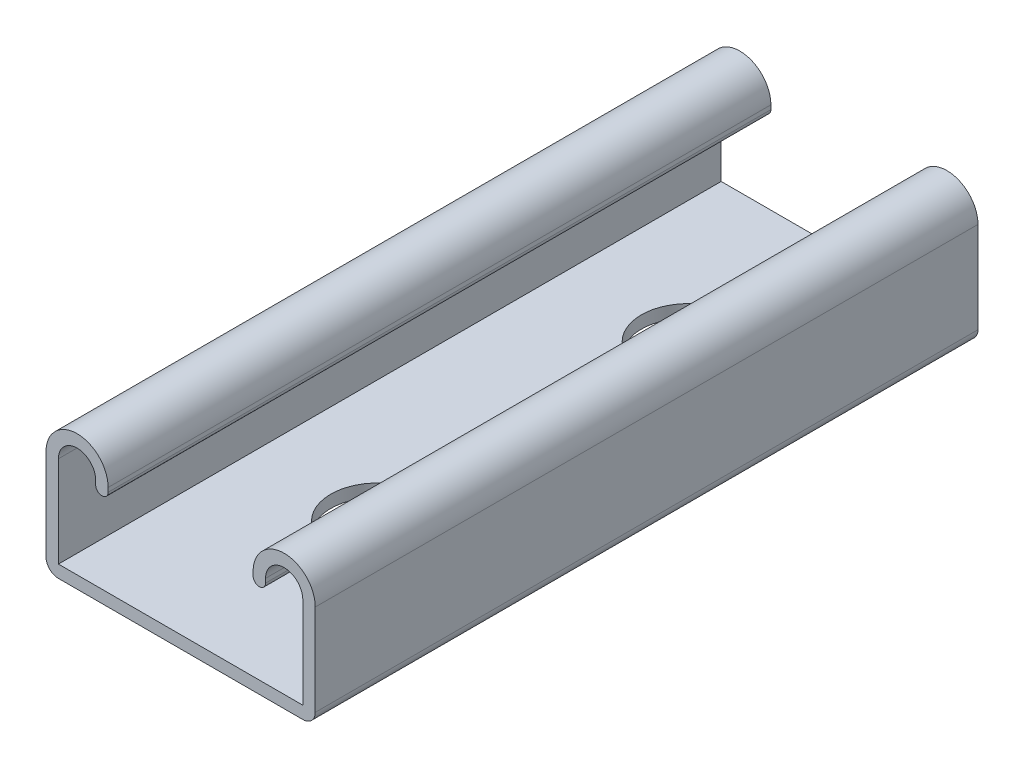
ISO-10303-21;
HEADER;
FILE_DESCRIPTION(('STEP AP214'),'2;1');
FILE_NAME('part.step','',(''),(''),'','','');
FILE_SCHEMA(('AUTOMOTIVE_DESIGN { 1 0 10303 214 1 1 1 1 }'));
ENDSEC;
DATA;
#1=APPLICATION_CONTEXT('core data for automotive mechanical design processes');
#2=APPLICATION_PROTOCOL_DEFINITION('international standard','automotive_design',2000,#1);
#3=PRODUCT_CONTEXT('',#1,'mechanical');
#4=PRODUCT('Part','Part','',(#3));
#5=PRODUCT_RELATED_PRODUCT_CATEGORY('part','',(#4));
#6=PRODUCT_DEFINITION_FORMATION('','',#4);
#7=PRODUCT_DEFINITION_CONTEXT('part definition',#1,'design');
#8=PRODUCT_DEFINITION('design','',#6,#7);
#9=PRODUCT_DEFINITION_SHAPE('','',#8);
#10=(LENGTH_UNIT() NAMED_UNIT(*) SI_UNIT(.MILLI.,.METRE.));
#11=(NAMED_UNIT(*) PLANE_ANGLE_UNIT() SI_UNIT($,.RADIAN.));
#12=(NAMED_UNIT(*) SI_UNIT($,.STERADIAN.) SOLID_ANGLE_UNIT());
#13=UNCERTAINTY_MEASURE_WITH_UNIT(LENGTH_MEASURE(1.E-05),#10,'distance_accuracy_value','');
#14=(GEOMETRIC_REPRESENTATION_CONTEXT(3) GLOBAL_UNCERTAINTY_ASSIGNED_CONTEXT((#13)) GLOBAL_UNIT_ASSIGNED_CONTEXT((#10,
#11,#12)) REPRESENTATION_CONTEXT('',''));
#15=CARTESIAN_POINT('',(0.,0.,0.));
#16=DIRECTION('',(0.,0.,1.));
#17=DIRECTION('',(1.,0.,0.));
#18=AXIS2_PLACEMENT_3D('',#15,#16,#17);
#19=CARTESIAN_POINT('',(-15.875,7.4295,101.6));
#20=DIRECTION('',(0.,0.,-1.));
#21=DIRECTION('',(-1.,0.,0.));
#22=AXIS2_PLACEMENT_3D('',#19,#20,#21);
#23=CYLINDRICAL_SURFACE('',#22,4.7625);
#24=CARTESIAN_POINT('',(-15.875,7.4295,0.));
#25=DIRECTION('',(0.,0.,1.));
#26=DIRECTION('',(-1.,0.,0.));
#27=AXIS2_PLACEMENT_3D('',#24,#25,#26);
#28=CIRCLE('',#27,4.7625);
#29=CARTESIAN_POINT('',(-11.1125,7.4295,0.));
#30=VERTEX_POINT('',#29);
#31=CARTESIAN_POINT('',(-20.6375,7.4295,0.));
#32=VERTEX_POINT('',#31);
#33=EDGE_CURVE('E190',#30,#32,#28,.T.);
#34=ORIENTED_EDGE('',*,*,#33,.T.);
#35=DIRECTION('',(0.,0.,-1.));
#36=VECTOR('',#35,1.);
#37=CARTESIAN_POINT('',(-20.6375,7.4295,101.6));
#38=LINE('',#37,#36);
#39=CARTESIAN_POINT('',(-20.6375,7.4295,101.6));
#40=VERTEX_POINT('',#39);
#41=EDGE_CURVE('E11',#40,#32,#38,.T.);
#42=ORIENTED_EDGE('',*,*,#41,.F.);
#43=CARTESIAN_POINT('',(-15.875,7.4295,101.6));
#44=DIRECTION('',(0.,0.,1.));
#45=DIRECTION('',(-1.,0.,0.));
#46=AXIS2_PLACEMENT_3D('',#43,#44,#45);
#47=CIRCLE('',#46,4.7625);
#48=CARTESIAN_POINT('',(-11.1125,7.4295,101.6));
#49=VERTEX_POINT('',#48);
#50=EDGE_CURVE('E224',#49,#40,#47,.T.);
#51=ORIENTED_EDGE('',*,*,#50,.F.);
#52=DIRECTION('',(0.,0.,-1.));
#53=VECTOR('',#52,1.);
#54=CARTESIAN_POINT('',(-11.1125,7.4295,101.6));
#55=LINE('',#54,#53);
#56=EDGE_CURVE('E186',#49,#30,#55,.T.);
#57=ORIENTED_EDGE('',*,*,#56,.T.);
#58=EDGE_LOOP('',(#34,#42,#51,#57));
#59=FACE_BOUND('',#58,.T.);
#60=ADVANCED_FACE('F33',(#59),#23,.T.);
#61=CARTESIAN_POINT('',(-20.6375,7.4295,101.6));
#62=DIRECTION('',(1.,0.,0.));
#63=DIRECTION('',(0.,0.,-1.));
#64=AXIS2_PLACEMENT_3D('',#61,#62,#63);
#65=PLANE('',#64);
#66=DIRECTION('',(0.,-1.,0.));
#67=VECTOR('',#66,1.);
#68=CARTESIAN_POINT('',(-20.6375,7.4295,0.));
#69=LINE('',#68,#67);
#70=CARTESIAN_POINT('',(-20.6375,-6.5532,0.));
#71=VERTEX_POINT('',#70);
#72=EDGE_CURVE('E193',#32,#71,#69,.T.);
#73=ORIENTED_EDGE('',*,*,#72,.T.);
#74=DIRECTION('',(0.,0.,-1.));
#75=VECTOR('',#74,1.);
#76=CARTESIAN_POINT('',(-20.6375,-6.5532,101.6));
#77=LINE('',#76,#75);
#78=CARTESIAN_POINT('',(-20.6375,-6.5532,101.6));
#79=VERTEX_POINT('',#78);
#80=EDGE_CURVE('E42',#79,#71,#77,.T.);
#81=ORIENTED_EDGE('',*,*,#80,.F.);
#82=DIRECTION('',(0.,-1.,0.));
#83=VECTOR('',#82,1.);
#84=CARTESIAN_POINT('',(-20.6375,7.4295,101.6));
#85=LINE('',#84,#83);
#86=EDGE_CURVE('E123',#40,#79,#85,.T.);
#87=ORIENTED_EDGE('',*,*,#86,.F.);
#88=ORIENTED_EDGE('',*,*,#41,.T.);
#89=EDGE_LOOP('',(#73,#81,#87,#88));
#90=FACE_BOUND('',#89,.T.);
#91=ADVANCED_FACE('F333',(#90),#65,.F.);
#92=CARTESIAN_POINT('',(-18.7325,-6.5532,101.6));
#93=DIRECTION('',(0.,0.,-1.));
#94=DIRECTION('',(-1.,0.,0.));
#95=AXIS2_PLACEMENT_3D('',#92,#93,#94);
#96=CYLINDRICAL_SURFACE('',#95,1.905);
#97=CARTESIAN_POINT('',(-18.7325,-6.5532,0.));
#98=DIRECTION('',(0.,0.,1.));
#99=DIRECTION('',(-1.,0.,0.));
#100=AXIS2_PLACEMENT_3D('',#97,#98,#99);
#101=CIRCLE('',#100,1.905);
#102=CARTESIAN_POINT('',(-18.7325,-8.4582,0.));
#103=VERTEX_POINT('',#102);
#104=EDGE_CURVE('E195',#71,#103,#101,.T.);
#105=ORIENTED_EDGE('',*,*,#104,.T.);
#106=DIRECTION('',(0.,0.,-1.));
#107=VECTOR('',#106,1.);
#108=CARTESIAN_POINT('',(-18.7325,-8.4582,101.6));
#109=LINE('',#108,#107);
#110=CARTESIAN_POINT('',(-18.7325,-8.4582,101.6));
#111=VERTEX_POINT('',#110);
#112=EDGE_CURVE('E261',#111,#103,#109,.T.);
#113=ORIENTED_EDGE('',*,*,#112,.F.);
#114=CARTESIAN_POINT('',(-18.7325,-6.5532,101.6));
#115=DIRECTION('',(0.,0.,1.));
#116=DIRECTION('',(-1.,0.,0.));
#117=AXIS2_PLACEMENT_3D('',#114,#115,#116);
#118=CIRCLE('',#117,1.905);
#119=EDGE_CURVE('E270',#79,#111,#118,.T.);
#120=ORIENTED_EDGE('',*,*,#119,.F.);
#121=ORIENTED_EDGE('',*,*,#80,.T.);
#122=EDGE_LOOP('',(#105,#113,#120,#121));
#123=FACE_BOUND('',#122,.T.);
#124=ADVANCED_FACE('F268',(#123),#96,.T.);
#125=CARTESIAN_POINT('',(-18.7325,-8.4582,101.6));
#126=DIRECTION('',(0.,1.,0.));
#127=DIRECTION('',(0.,0.,1.));
#128=AXIS2_PLACEMENT_3D('',#125,#126,#127);
#129=PLANE('',#128);
#130=CARTESIAN_POINT('',(0.,-8.4582,71.4375));
#131=DIRECTION('',(0.,-1.,0.));
#132=DIRECTION('',(0.,0.,-1.));
#133=AXIS2_PLACEMENT_3D('',#130,#131,#132);
#134=CIRCLE('',#133,7.14375);
#135=CARTESIAN_POINT('',(0.,-8.4582,64.29375));
#136=VERTEX_POINT('',#135);
#137=EDGE_CURVE('E452',#136,#136,#134,.T.);
#138=ORIENTED_EDGE('',*,*,#137,.F.);
#139=EDGE_LOOP('',(#138));
#140=FACE_BOUND('',#139,.T.);
#141=CARTESIAN_POINT('',(0.,-8.4582,23.8125));
#142=DIRECTION('',(0.,-1.,0.));
#143=DIRECTION('',(0.,0.,-1.));
#144=AXIS2_PLACEMENT_3D('',#141,#142,#143);
#145=CIRCLE('',#144,7.14375);
#146=CARTESIAN_POINT('',(0.,-8.4582,16.66875));
#147=VERTEX_POINT('',#146);
#148=EDGE_CURVE('E456',#147,#147,#145,.T.);
#149=ORIENTED_EDGE('',*,*,#148,.F.);
#150=EDGE_LOOP('',(#149));
#151=FACE_BOUND('',#150,.T.);
#152=DIRECTION('',(1.,0.,0.));
#153=VECTOR('',#152,1.);
#154=CARTESIAN_POINT('',(-18.7325,-8.4582,0.));
#155=LINE('',#154,#153);
#156=CARTESIAN_POINT('',(18.7325,-8.4582,0.));
#157=VERTEX_POINT('',#156);
#158=EDGE_CURVE('E197',#103,#157,#155,.T.);
#159=ORIENTED_EDGE('',*,*,#158,.T.);
#160=DIRECTION('',(0.,0.,-1.));
#161=VECTOR('',#160,1.);
#162=CARTESIAN_POINT('',(18.7325,-8.4582,101.6));
#163=LINE('',#162,#161);
#164=CARTESIAN_POINT('',(18.7325,-8.4582,101.6));
#165=VERTEX_POINT('',#164);
#166=EDGE_CURVE('E258',#165,#157,#163,.T.);
#167=ORIENTED_EDGE('',*,*,#166,.F.);
#168=DIRECTION('',(1.,0.,0.));
#169=VECTOR('',#168,1.);
#170=CARTESIAN_POINT('',(-18.7325,-8.4582,101.6));
#171=LINE('',#170,#169);
#172=EDGE_CURVE('E288',#111,#165,#171,.T.);
#173=ORIENTED_EDGE('',*,*,#172,.F.);
#174=ORIENTED_EDGE('',*,*,#112,.T.);
#175=EDGE_LOOP('',(#159,#167,#173,#174));
#176=FACE_BOUND('',#175,.T.);
#177=ADVANCED_FACE('F279',(#140,#151,#176),#129,.F.);
#178=CARTESIAN_POINT('',(18.7325,-6.5532,101.6));
#179=DIRECTION('',(0.,0.,-1.));
#180=DIRECTION('',(-1.,0.,0.));
#181=AXIS2_PLACEMENT_3D('',#178,#179,#180);
#182=CYLINDRICAL_SURFACE('',#181,1.905);
#183=CARTESIAN_POINT('',(18.7325,-6.5532,0.));
#184=DIRECTION('',(0.,0.,1.));
#185=DIRECTION('',(1.,0.,0.));
#186=AXIS2_PLACEMENT_3D('',#183,#184,#185);
#187=CIRCLE('',#186,1.905);
#188=CARTESIAN_POINT('',(20.6375,-6.5532,0.));
#189=VERTEX_POINT('',#188);
#190=EDGE_CURVE('E199',#157,#189,#187,.T.);
#191=ORIENTED_EDGE('',*,*,#190,.T.);
#192=DIRECTION('',(0.,0.,-1.));
#193=VECTOR('',#192,1.);
#194=CARTESIAN_POINT('',(20.6375,-6.5532,101.6));
#195=LINE('',#194,#193);
#196=CARTESIAN_POINT('',(20.6375,-6.5532,101.6));
#197=VERTEX_POINT('',#196);
#198=EDGE_CURVE('E255',#197,#189,#195,.T.);
#199=ORIENTED_EDGE('',*,*,#198,.F.);
#200=CARTESIAN_POINT('',(18.7325,-6.5532,101.6));
#201=DIRECTION('',(0.,0.,1.));
#202=DIRECTION('',(1.,0.,0.));
#203=AXIS2_PLACEMENT_3D('',#200,#201,#202);
#204=CIRCLE('',#203,1.905);
#205=EDGE_CURVE('E285',#165,#197,#204,.T.);
#206=ORIENTED_EDGE('',*,*,#205,.F.);
#207=ORIENTED_EDGE('',*,*,#166,.T.);
#208=EDGE_LOOP('',(#191,#199,#206,#207));
#209=FACE_BOUND('',#208,.T.);
#210=ADVANCED_FACE('F283',(#209),#182,.T.);
#211=CARTESIAN_POINT('',(20.6375,-6.5532,101.6));
#212=DIRECTION('',(-1.,0.,0.));
#213=DIRECTION('',(0.,-1.,0.));
#214=AXIS2_PLACEMENT_3D('',#211,#212,#213);
#215=PLANE('',#214);
#216=DIRECTION('',(0.,1.,0.));
#217=VECTOR('',#216,1.);
#218=CARTESIAN_POINT('',(20.6375,-6.5532,0.));
#219=LINE('',#218,#217);
#220=CARTESIAN_POINT('',(20.6375,7.4295,0.));
#221=VERTEX_POINT('',#220);
#222=EDGE_CURVE('E201',#189,#221,#219,.T.);
#223=ORIENTED_EDGE('',*,*,#222,.T.);
#224=DIRECTION('',(0.,0.,-1.));
#225=VECTOR('',#224,1.);
#226=CARTESIAN_POINT('',(20.6375,7.4295,101.6));
#227=LINE('',#226,#225);
#228=CARTESIAN_POINT('',(20.6375,7.4295,101.6));
#229=VERTEX_POINT('',#228);
#230=EDGE_CURVE('E252',#229,#221,#227,.T.);
#231=ORIENTED_EDGE('',*,*,#230,.F.);
#232=DIRECTION('',(0.,1.,0.));
#233=VECTOR('',#232,1.);
#234=CARTESIAN_POINT('',(20.6375,-6.5532,101.6));
#235=LINE('',#234,#233);
#236=EDGE_CURVE('E287',#197,#229,#235,.T.);
#237=ORIENTED_EDGE('',*,*,#236,.F.);
#238=ORIENTED_EDGE('',*,*,#198,.T.);
#239=EDGE_LOOP('',(#223,#231,#237,#238));
#240=FACE_BOUND('',#239,.T.);
#241=ADVANCED_FACE('F347',(#240),#215,.F.);
#242=CARTESIAN_POINT('',(15.875,7.4295,101.6));
#243=DIRECTION('',(0.,0.,-1.));
#244=DIRECTION('',(-1.,0.,0.));
#245=AXIS2_PLACEMENT_3D('',#242,#243,#244);
#246=CYLINDRICAL_SURFACE('',#245,4.7625);
#247=CARTESIAN_POINT('',(15.875,7.4295,0.));
#248=DIRECTION('',(0.,0.,1.));
#249=DIRECTION('',(1.,0.,0.));
#250=AXIS2_PLACEMENT_3D('',#247,#248,#249);
#251=CIRCLE('',#250,4.7625);
#252=CARTESIAN_POINT('',(11.1125,7.4295,0.));
#253=VERTEX_POINT('',#252);
#254=EDGE_CURVE('E203',#221,#253,#251,.T.);
#255=ORIENTED_EDGE('',*,*,#254,.T.);
#256=DIRECTION('',(0.,0.,-1.));
#257=VECTOR('',#256,1.);
#258=CARTESIAN_POINT('',(11.1125,7.4295,101.6));
#259=LINE('',#258,#257);
#260=CARTESIAN_POINT('',(11.1125,7.4295,101.6));
#261=VERTEX_POINT('',#260);
#262=EDGE_CURVE('E249',#261,#253,#259,.T.);
#263=ORIENTED_EDGE('',*,*,#262,.F.);
#264=CARTESIAN_POINT('',(15.875,7.4295,101.6));
#265=DIRECTION('',(0.,0.,1.));
#266=DIRECTION('',(1.,0.,0.));
#267=AXIS2_PLACEMENT_3D('',#264,#265,#266);
#268=CIRCLE('',#267,4.7625);
#269=EDGE_CURVE('E290',#229,#261,#268,.T.);
#270=ORIENTED_EDGE('',*,*,#269,.F.);
#271=ORIENTED_EDGE('',*,*,#230,.T.);
#272=EDGE_LOOP('',(#255,#263,#270,#271));
#273=FACE_BOUND('',#272,.T.);
#274=ADVANCED_FACE('F350',(#273),#246,.T.);
#275=CARTESIAN_POINT('',(11.1125,7.4295,101.6));
#276=DIRECTION('',(1.,0.,0.));
#277=DIRECTION('',(0.,1.,0.));
#278=AXIS2_PLACEMENT_3D('',#275,#276,#277);
#279=PLANE('',#278);
#280=DIRECTION('',(0.,-1.,0.));
#281=VECTOR('',#280,1.);
#282=CARTESIAN_POINT('',(11.1125,7.4295,0.));
#283=LINE('',#282,#281);
#284=CARTESIAN_POINT('',(11.1125,6.7945,0.));
#285=VERTEX_POINT('',#284);
#286=EDGE_CURVE('E205',#253,#285,#283,.T.);
#287=ORIENTED_EDGE('',*,*,#286,.T.);
#288=DIRECTION('',(0.,0.,-1.));
#289=VECTOR('',#288,1.);
#290=CARTESIAN_POINT('',(11.1125,6.7945,101.6));
#291=LINE('',#290,#289);
#292=CARTESIAN_POINT('',(11.1125,6.7945,101.6));
#293=VERTEX_POINT('',#292);
#294=EDGE_CURVE('E246',#293,#285,#291,.T.);
#295=ORIENTED_EDGE('',*,*,#294,.F.);
#296=DIRECTION('',(0.,-1.,0.));
#297=VECTOR('',#296,1.);
#298=CARTESIAN_POINT('',(11.1125,7.4295,101.6));
#299=LINE('',#298,#297);
#300=EDGE_CURVE('E296',#261,#293,#299,.T.);
#301=ORIENTED_EDGE('',*,*,#300,.F.);
#302=ORIENTED_EDGE('',*,*,#262,.T.);
#303=EDGE_LOOP('',(#287,#295,#301,#302));
#304=FACE_BOUND('',#303,.T.);
#305=ADVANCED_FACE('F354',(#304),#279,.F.);
#306=CARTESIAN_POINT('',(12.065,6.7945,101.6));
#307=DIRECTION('',(0.,0.,-1.));
#308=DIRECTION('',(-1.,0.,0.));
#309=AXIS2_PLACEMENT_3D('',#306,#307,#308);
#310=CYLINDRICAL_SURFACE('',#309,0.952500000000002);
#311=CARTESIAN_POINT('',(12.065,6.7945,0.));
#312=DIRECTION('',(0.,0.,1.));
#313=DIRECTION('',(1.,0.,0.));
#314=AXIS2_PLACEMENT_3D('',#311,#312,#313);
#315=CIRCLE('',#314,0.952500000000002);
#316=CARTESIAN_POINT('',(13.0175,6.7945,0.));
#317=VERTEX_POINT('',#316);
#318=EDGE_CURVE('E207',#285,#317,#315,.T.);
#319=ORIENTED_EDGE('',*,*,#318,.T.);
#320=DIRECTION('',(0.,0.,-1.));
#321=VECTOR('',#320,1.);
#322=CARTESIAN_POINT('',(13.0175,6.7945,101.6));
#323=LINE('',#322,#321);
#324=CARTESIAN_POINT('',(13.0175,6.7945,101.6));
#325=VERTEX_POINT('',#324);
#326=EDGE_CURVE('E243',#325,#317,#323,.T.);
#327=ORIENTED_EDGE('',*,*,#326,.F.);
#328=CARTESIAN_POINT('',(12.065,6.7945,101.6));
#329=DIRECTION('',(0.,0.,1.));
#330=DIRECTION('',(1.,0.,0.));
#331=AXIS2_PLACEMENT_3D('',#328,#329,#330);
#332=CIRCLE('',#331,0.952500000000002);
#333=EDGE_CURVE('E298',#293,#325,#332,.T.);
#334=ORIENTED_EDGE('',*,*,#333,.F.);
#335=ORIENTED_EDGE('',*,*,#294,.T.);
#336=EDGE_LOOP('',(#319,#327,#334,#335));
#337=FACE_BOUND('',#336,.T.);
#338=ADVANCED_FACE('F358',(#337),#310,.T.);
#339=CARTESIAN_POINT('',(13.0175,7.4295,101.6));
#340=DIRECTION('',(-1.,0.,0.));
#341=DIRECTION('',(0.,-1.,0.));
#342=AXIS2_PLACEMENT_3D('',#339,#340,#341);
#343=PLANE('',#342);
#344=DIRECTION('',(0.,1.,0.));
#345=VECTOR('',#344,1.);
#346=CARTESIAN_POINT('',(13.0175,7.4295,0.));
#347=LINE('',#346,#345);
#348=CARTESIAN_POINT('',(13.0175,7.4295,0.));
#349=VERTEX_POINT('',#348);
#350=EDGE_CURVE('E209',#317,#349,#347,.T.);
#351=ORIENTED_EDGE('',*,*,#350,.T.);
#352=DIRECTION('',(0.,0.,-1.));
#353=VECTOR('',#352,1.);
#354=CARTESIAN_POINT('',(13.0175,7.4295,101.6));
#355=LINE('',#354,#353);
#356=CARTESIAN_POINT('',(13.0175,7.4295,101.6));
#357=VERTEX_POINT('',#356);
#358=EDGE_CURVE('E240',#357,#349,#355,.T.);
#359=ORIENTED_EDGE('',*,*,#358,.F.);
#360=DIRECTION('',(0.,1.,0.));
#361=VECTOR('',#360,1.);
#362=CARTESIAN_POINT('',(13.0175,7.4295,101.6));
#363=LINE('',#362,#361);
#364=EDGE_CURVE('E300',#325,#357,#363,.T.);
#365=ORIENTED_EDGE('',*,*,#364,.F.);
#366=ORIENTED_EDGE('',*,*,#326,.T.);
#367=EDGE_LOOP('',(#351,#359,#365,#366));
#368=FACE_BOUND('',#367,.T.);
#369=ADVANCED_FACE('F362',(#368),#343,.F.);
#370=CARTESIAN_POINT('',(15.875,7.4295,101.6));
#371=DIRECTION('',(0.,0.,-1.));
#372=DIRECTION('',(-1.,0.,0.));
#373=AXIS2_PLACEMENT_3D('',#370,#371,#372);
#374=CYLINDRICAL_SURFACE('',#373,2.8575);
#375=CARTESIAN_POINT('',(15.875,7.4295,0.));
#376=DIRECTION('',(0.,0.,-1.));
#377=DIRECTION('',(1.,0.,0.));
#378=AXIS2_PLACEMENT_3D('',#375,#376,#377);
#379=CIRCLE('',#378,2.8575);
#380=CARTESIAN_POINT('',(18.7325,7.4295,0.));
#381=VERTEX_POINT('',#380);
#382=EDGE_CURVE('E211',#349,#381,#379,.T.);
#383=ORIENTED_EDGE('',*,*,#382,.T.);
#384=DIRECTION('',(0.,0.,-1.));
#385=VECTOR('',#384,1.);
#386=CARTESIAN_POINT('',(18.7325,7.4295,101.6));
#387=LINE('',#386,#385);
#388=CARTESIAN_POINT('',(18.7325,7.4295,101.6));
#389=VERTEX_POINT('',#388);
#390=EDGE_CURVE('E237',#389,#381,#387,.T.);
#391=ORIENTED_EDGE('',*,*,#390,.F.);
#392=CARTESIAN_POINT('',(15.875,7.4295,101.6));
#393=DIRECTION('',(0.,0.,-1.));
#394=DIRECTION('',(1.,0.,0.));
#395=AXIS2_PLACEMENT_3D('',#392,#393,#394);
#396=CIRCLE('',#395,2.8575);
#397=EDGE_CURVE('E302',#357,#389,#396,.T.);
#398=ORIENTED_EDGE('',*,*,#397,.F.);
#399=ORIENTED_EDGE('',*,*,#358,.T.);
#400=EDGE_LOOP('',(#383,#391,#398,#399));
#401=FACE_BOUND('',#400,.T.);
#402=ADVANCED_FACE('F366',(#401),#374,.F.);
#403=CARTESIAN_POINT('',(18.7325,-6.5532,101.6));
#404=DIRECTION('',(1.,0.,0.));
#405=DIRECTION('',(0.,1.,0.));
#406=AXIS2_PLACEMENT_3D('',#403,#404,#405);
#407=PLANE('',#406);
#408=DIRECTION('',(0.,-1.,0.));
#409=VECTOR('',#408,1.);
#410=CARTESIAN_POINT('',(18.7325,-6.5532,0.));
#411=LINE('',#410,#409);
#412=CARTESIAN_POINT('',(18.7325,-6.5532,0.));
#413=VERTEX_POINT('',#412);
#414=EDGE_CURVE('E213',#381,#413,#411,.T.);
#415=ORIENTED_EDGE('',*,*,#414,.T.);
#416=DIRECTION('',(0.,0.,-1.));
#417=VECTOR('',#416,1.);
#418=CARTESIAN_POINT('',(18.7325,-6.5532,101.6));
#419=LINE('',#418,#417);
#420=CARTESIAN_POINT('',(18.7325,-6.5532,101.6));
#421=VERTEX_POINT('',#420);
#422=EDGE_CURVE('E234',#421,#413,#419,.T.);
#423=ORIENTED_EDGE('',*,*,#422,.F.);
#424=DIRECTION('',(0.,-1.,0.));
#425=VECTOR('',#424,1.);
#426=CARTESIAN_POINT('',(18.7325,-6.5532,101.6));
#427=LINE('',#426,#425);
#428=EDGE_CURVE('E304',#389,#421,#427,.T.);
#429=ORIENTED_EDGE('',*,*,#428,.F.);
#430=ORIENTED_EDGE('',*,*,#390,.T.);
#431=EDGE_LOOP('',(#415,#423,#429,#430));
#432=FACE_BOUND('',#431,.T.);
#433=ADVANCED_FACE('F370',(#432),#407,.F.);
#434=CARTESIAN_POINT('',(-18.7325,-6.5532,101.6));
#435=DIRECTION('',(0.,-1.,0.));
#436=DIRECTION('',(0.,0.,-1.));
#437=AXIS2_PLACEMENT_3D('',#434,#435,#436);
#438=PLANE('',#437);
#439=CARTESIAN_POINT('',(0.,-6.5532,71.4375));
#440=DIRECTION('',(0.,-1.,0.));
#441=DIRECTION('',(0.,0.,-1.));
#442=AXIS2_PLACEMENT_3D('',#439,#440,#441);
#443=CIRCLE('',#442,7.14375);
#444=CARTESIAN_POINT('',(0.,-6.5532,64.29375));
#445=VERTEX_POINT('',#444);
#446=EDGE_CURVE('E455',#445,#445,#443,.T.);
#447=ORIENTED_EDGE('',*,*,#446,.T.);
#448=EDGE_LOOP('',(#447));
#449=FACE_BOUND('',#448,.T.);
#450=CARTESIAN_POINT('',(0.,-6.5532,23.8125));
#451=DIRECTION('',(0.,-1.,0.));
#452=DIRECTION('',(0.,0.,-1.));
#453=AXIS2_PLACEMENT_3D('',#450,#451,#452);
#454=CIRCLE('',#453,7.14375);
#455=CARTESIAN_POINT('',(0.,-6.5532,16.66875));
#456=VERTEX_POINT('',#455);
#457=EDGE_CURVE('E36',#456,#456,#454,.T.);
#458=ORIENTED_EDGE('',*,*,#457,.T.);
#459=EDGE_LOOP('',(#458));
#460=FACE_BOUND('',#459,.T.);
#461=DIRECTION('',(-1.,0.,0.));
#462=VECTOR('',#461,1.);
#463=CARTESIAN_POINT('',(-18.7325,-6.5532,0.));
#464=LINE('',#463,#462);
#465=CARTESIAN_POINT('',(-18.7325,-6.5532,0.));
#466=VERTEX_POINT('',#465);
#467=EDGE_CURVE('E215',#413,#466,#464,.T.);
#468=ORIENTED_EDGE('',*,*,#467,.T.);
#469=DIRECTION('',(0.,0.,-1.));
#470=VECTOR('',#469,1.);
#471=CARTESIAN_POINT('',(-18.7325,-6.5532,101.6));
#472=LINE('',#471,#470);
#473=CARTESIAN_POINT('',(-18.7325,-6.5532,101.6));
#474=VERTEX_POINT('',#473);
#475=EDGE_CURVE('E231',#474,#466,#472,.T.);
#476=ORIENTED_EDGE('',*,*,#475,.F.);
#477=DIRECTION('',(-1.,0.,0.));
#478=VECTOR('',#477,1.);
#479=CARTESIAN_POINT('',(-18.7325,-6.5532,101.6));
#480=LINE('',#479,#478);
#481=EDGE_CURVE('E306',#421,#474,#480,.T.);
#482=ORIENTED_EDGE('',*,*,#481,.F.);
#483=ORIENTED_EDGE('',*,*,#422,.T.);
#484=EDGE_LOOP('',(#468,#476,#482,#483));
#485=FACE_BOUND('',#484,.T.);
#486=ADVANCED_FACE('F374',(#449,#460,#485),#438,.F.);
#487=CARTESIAN_POINT('',(-18.7325,7.4295,101.6));
#488=DIRECTION('',(-1.,0.,0.));
#489=DIRECTION('',(0.,0.,1.));
#490=AXIS2_PLACEMENT_3D('',#487,#488,#489);
#491=PLANE('',#490);
#492=DIRECTION('',(0.,1.,0.));
#493=VECTOR('',#492,1.);
#494=CARTESIAN_POINT('',(-18.7325,7.4295,0.));
#495=LINE('',#494,#493);
#496=CARTESIAN_POINT('',(-18.7325,7.4295,0.));
#497=VERTEX_POINT('',#496);
#498=EDGE_CURVE('E217',#466,#497,#495,.T.);
#499=ORIENTED_EDGE('',*,*,#498,.T.);
#500=DIRECTION('',(0.,0.,-1.));
#501=VECTOR('',#500,1.);
#502=CARTESIAN_POINT('',(-18.7325,7.4295,101.6));
#503=LINE('',#502,#501);
#504=CARTESIAN_POINT('',(-18.7325,7.4295,101.6));
#505=VERTEX_POINT('',#504);
#506=EDGE_CURVE('E228',#505,#497,#503,.T.);
#507=ORIENTED_EDGE('',*,*,#506,.F.);
#508=DIRECTION('',(0.,1.,0.));
#509=VECTOR('',#508,1.);
#510=CARTESIAN_POINT('',(-18.7325,7.4295,101.6));
#511=LINE('',#510,#509);
#512=EDGE_CURVE('E308',#474,#505,#511,.T.);
#513=ORIENTED_EDGE('',*,*,#512,.F.);
#514=ORIENTED_EDGE('',*,*,#475,.T.);
#515=EDGE_LOOP('',(#499,#507,#513,#514));
#516=FACE_BOUND('',#515,.T.);
#517=ADVANCED_FACE('F314',(#516),#491,.F.);
#518=CARTESIAN_POINT('',(-15.875,7.4295,101.6));
#519=DIRECTION('',(0.,0.,-1.));
#520=DIRECTION('',(-1.,0.,0.));
#521=AXIS2_PLACEMENT_3D('',#518,#519,#520);
#522=CYLINDRICAL_SURFACE('',#521,2.8575);
#523=CARTESIAN_POINT('',(-15.875,7.4295,0.));
#524=DIRECTION('',(0.,0.,-1.));
#525=DIRECTION('',(-1.,0.,0.));
#526=AXIS2_PLACEMENT_3D('',#523,#524,#525);
#527=CIRCLE('',#526,2.8575);
#528=CARTESIAN_POINT('',(-13.0175,7.4295,0.));
#529=VERTEX_POINT('',#528);
#530=EDGE_CURVE('E219',#497,#529,#527,.T.);
#531=ORIENTED_EDGE('',*,*,#530,.T.);
#532=DIRECTION('',(0.,0.,-1.));
#533=VECTOR('',#532,1.);
#534=CARTESIAN_POINT('',(-13.0175,7.4295,101.6));
#535=LINE('',#534,#533);
#536=CARTESIAN_POINT('',(-13.0175,7.4295,101.6));
#537=VERTEX_POINT('',#536);
#538=EDGE_CURVE('E181',#537,#529,#535,.T.);
#539=ORIENTED_EDGE('',*,*,#538,.F.);
#540=CARTESIAN_POINT('',(-15.875,7.4295,101.6));
#541=DIRECTION('',(0.,0.,-1.));
#542=DIRECTION('',(-1.,0.,0.));
#543=AXIS2_PLACEMENT_3D('',#540,#541,#542);
#544=CIRCLE('',#543,2.8575);
#545=EDGE_CURVE('E172',#505,#537,#544,.T.);
#546=ORIENTED_EDGE('',*,*,#545,.F.);
#547=ORIENTED_EDGE('',*,*,#506,.T.);
#548=EDGE_LOOP('',(#531,#539,#546,#547));
#549=FACE_BOUND('',#548,.T.);
#550=ADVANCED_FACE('F318',(#549),#522,.F.);
#551=CARTESIAN_POINT('',(-13.0175,7.4295,101.6));
#552=DIRECTION('',(1.,0.,0.));
#553=DIRECTION('',(0.,1.,0.));
#554=AXIS2_PLACEMENT_3D('',#551,#552,#553);
#555=PLANE('',#554);
#556=DIRECTION('',(0.,-1.,0.));
#557=VECTOR('',#556,1.);
#558=CARTESIAN_POINT('',(-13.0175,7.4295,0.));
#559=LINE('',#558,#557);
#560=CARTESIAN_POINT('',(-13.0175,6.7945,0.));
#561=VERTEX_POINT('',#560);
#562=EDGE_CURVE('E180',#529,#561,#559,.T.);
#563=ORIENTED_EDGE('',*,*,#562,.T.);
#564=DIRECTION('',(0.,0.,-1.));
#565=VECTOR('',#564,1.);
#566=CARTESIAN_POINT('',(-13.0175,6.7945,101.6));
#567=LINE('',#566,#565);
#568=CARTESIAN_POINT('',(-13.0175,6.7945,101.6));
#569=VERTEX_POINT('',#568);
#570=EDGE_CURVE('E177',#569,#561,#567,.T.);
#571=ORIENTED_EDGE('',*,*,#570,.F.);
#572=DIRECTION('',(0.,-1.,0.));
#573=VECTOR('',#572,1.);
#574=CARTESIAN_POINT('',(-13.0175,7.4295,101.6));
#575=LINE('',#574,#573);
#576=EDGE_CURVE('E166',#537,#569,#575,.T.);
#577=ORIENTED_EDGE('',*,*,#576,.F.);
#578=ORIENTED_EDGE('',*,*,#538,.T.);
#579=EDGE_LOOP('',(#563,#571,#577,#578));
#580=FACE_BOUND('',#579,.T.);
#581=ADVANCED_FACE('F178',(#580),#555,.F.);
#582=CARTESIAN_POINT('',(-12.065,6.7945,101.6));
#583=DIRECTION('',(0.,0.,-1.));
#584=DIRECTION('',(-1.,0.,0.));
#585=AXIS2_PLACEMENT_3D('',#582,#583,#584);
#586=CYLINDRICAL_SURFACE('',#585,0.952499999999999);
#587=CARTESIAN_POINT('',(-12.065,6.7945,0.));
#588=DIRECTION('',(0.,0.,1.));
#589=DIRECTION('',(-1.,0.,0.));
#590=AXIS2_PLACEMENT_3D('',#587,#588,#589);
#591=CIRCLE('',#590,0.952499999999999);
#592=CARTESIAN_POINT('',(-11.1125,6.7945,0.));
#593=VERTEX_POINT('',#592);
#594=EDGE_CURVE('E109',#561,#593,#591,.T.);
#595=ORIENTED_EDGE('',*,*,#594,.T.);
#596=DIRECTION('',(0.,0.,-1.));
#597=VECTOR('',#596,1.);
#598=CARTESIAN_POINT('',(-11.1125,6.7945,101.6));
#599=LINE('',#598,#597);
#600=CARTESIAN_POINT('',(-11.1125,6.7945,101.6));
#601=VERTEX_POINT('',#600);
#602=EDGE_CURVE('E182',#601,#593,#599,.T.);
#603=ORIENTED_EDGE('',*,*,#602,.F.);
#604=CARTESIAN_POINT('',(-12.065,6.7945,101.6));
#605=DIRECTION('',(0.,0.,1.));
#606=DIRECTION('',(-1.,0.,0.));
#607=AXIS2_PLACEMENT_3D('',#604,#605,#606);
#608=CIRCLE('',#607,0.952499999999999);
#609=EDGE_CURVE('E170',#569,#601,#608,.T.);
#610=ORIENTED_EDGE('',*,*,#609,.F.);
#611=ORIENTED_EDGE('',*,*,#570,.T.);
#612=EDGE_LOOP('',(#595,#603,#610,#611));
#613=FACE_BOUND('',#612,.T.);
#614=ADVANCED_FACE('F184',(#613),#586,.T.);
#615=CARTESIAN_POINT('',(-11.1125,7.4295,101.6));
#616=DIRECTION('',(-1.,0.,0.));
#617=DIRECTION('',(0.,-1.,0.));
#618=AXIS2_PLACEMENT_3D('',#615,#616,#617);
#619=PLANE('',#618);
#620=DIRECTION('',(0.,1.,0.));
#621=VECTOR('',#620,1.);
#622=CARTESIAN_POINT('',(-11.1125,7.4295,0.));
#623=LINE('',#622,#621);
#624=EDGE_CURVE('E115',#593,#30,#623,.T.);
#625=ORIENTED_EDGE('',*,*,#624,.T.);
#626=ORIENTED_EDGE('',*,*,#56,.F.);
#627=DIRECTION('',(0.,1.,0.));
#628=VECTOR('',#627,1.);
#629=CARTESIAN_POINT('',(-11.1125,7.4295,101.6));
#630=LINE('',#629,#628);
#631=EDGE_CURVE('E50',#601,#49,#630,.T.);
#632=ORIENTED_EDGE('',*,*,#631,.F.);
#633=ORIENTED_EDGE('',*,*,#602,.T.);
#634=EDGE_LOOP('',(#625,#626,#632,#633));
#635=FACE_BOUND('',#634,.T.);
#636=ADVANCED_FACE('F322',(#635),#619,.F.);
#637=CARTESIAN_POINT('',(-15.875,7.4295,101.6));
#638=DIRECTION('',(0.,0.,-1.));
#639=DIRECTION('',(-1.,0.,0.));
#640=AXIS2_PLACEMENT_3D('',#637,#638,#639);
#641=PLANE('',#640);
#642=ORIENTED_EDGE('',*,*,#50,.T.);
#643=ORIENTED_EDGE('',*,*,#86,.T.);
#644=ORIENTED_EDGE('',*,*,#119,.T.);
#645=ORIENTED_EDGE('',*,*,#172,.T.);
#646=ORIENTED_EDGE('',*,*,#205,.T.);
#647=ORIENTED_EDGE('',*,*,#236,.T.);
#648=ORIENTED_EDGE('',*,*,#269,.T.);
#649=ORIENTED_EDGE('',*,*,#300,.T.);
#650=ORIENTED_EDGE('',*,*,#333,.T.);
#651=ORIENTED_EDGE('',*,*,#364,.T.);
#652=ORIENTED_EDGE('',*,*,#397,.T.);
#653=ORIENTED_EDGE('',*,*,#428,.T.);
#654=ORIENTED_EDGE('',*,*,#481,.T.);
#655=ORIENTED_EDGE('',*,*,#512,.T.);
#656=ORIENTED_EDGE('',*,*,#545,.T.);
#657=ORIENTED_EDGE('',*,*,#576,.T.);
#658=ORIENTED_EDGE('',*,*,#609,.T.);
#659=ORIENTED_EDGE('',*,*,#631,.T.);
#660=EDGE_LOOP('',(#642,#643,#644,#645,#646,#647,#648,#649,#650,#651,#652,#653,#654,#655,#656,
#657,#658,#659));
#661=FACE_BOUND('',#660,.T.);
#662=ADVANCED_FACE('F168',(#661),#641,.F.);
#663=CARTESIAN_POINT('',(-15.875,7.4295,0.));
#664=DIRECTION('',(0.,0.,-1.));
#665=DIRECTION('',(-1.,0.,0.));
#666=AXIS2_PLACEMENT_3D('',#663,#664,#665);
#667=PLANE('',#666);
#668=ORIENTED_EDGE('',*,*,#33,.F.);
#669=ORIENTED_EDGE('',*,*,#624,.F.);
#670=ORIENTED_EDGE('',*,*,#594,.F.);
#671=ORIENTED_EDGE('',*,*,#562,.F.);
#672=ORIENTED_EDGE('',*,*,#530,.F.);
#673=ORIENTED_EDGE('',*,*,#498,.F.);
#674=ORIENTED_EDGE('',*,*,#467,.F.);
#675=ORIENTED_EDGE('',*,*,#414,.F.);
#676=ORIENTED_EDGE('',*,*,#382,.F.);
#677=ORIENTED_EDGE('',*,*,#350,.F.);
#678=ORIENTED_EDGE('',*,*,#318,.F.);
#679=ORIENTED_EDGE('',*,*,#286,.F.);
#680=ORIENTED_EDGE('',*,*,#254,.F.);
#681=ORIENTED_EDGE('',*,*,#222,.F.);
#682=ORIENTED_EDGE('',*,*,#190,.F.);
#683=ORIENTED_EDGE('',*,*,#158,.F.);
#684=ORIENTED_EDGE('',*,*,#104,.F.);
#685=ORIENTED_EDGE('',*,*,#72,.F.);
#686=EDGE_LOOP('',(#668,#669,#670,#671,#672,#673,#674,#675,#676,#677,#678,#679,#680,#681,#682,
#683,#684,#685));
#687=FACE_BOUND('',#686,.T.);
#688=ADVANCED_FACE('F274',(#687),#667,.T.);
#689=CARTESIAN_POINT('',(0.,12.192,23.8125));
#690=DIRECTION('',(0.,-1.,0.));
#691=DIRECTION('',(0.,0.,-1.));
#692=AXIS2_PLACEMENT_3D('',#689,#690,#691);
#693=CYLINDRICAL_SURFACE('',#692,7.14375);
#694=ORIENTED_EDGE('',*,*,#148,.T.);
#695=EDGE_LOOP('',(#694));
#696=FACE_BOUND('',#695,.T.);
#697=ORIENTED_EDGE('',*,*,#457,.F.);
#698=EDGE_LOOP('',(#697));
#699=FACE_BOUND('',#698,.T.);
#700=ADVANCED_FACE('F411',(#696,#699),#693,.F.);
#701=CARTESIAN_POINT('',(0.,12.192,71.4375));
#702=DIRECTION('',(0.,-1.,0.));
#703=DIRECTION('',(0.,0.,-1.));
#704=AXIS2_PLACEMENT_3D('',#701,#702,#703);
#705=CYLINDRICAL_SURFACE('',#704,7.14375);
#706=ORIENTED_EDGE('',*,*,#137,.T.);
#707=EDGE_LOOP('',(#706));
#708=FACE_BOUND('',#707,.T.);
#709=ORIENTED_EDGE('',*,*,#446,.F.);
#710=EDGE_LOOP('',(#709));
#711=FACE_BOUND('',#710,.T.);
#712=ADVANCED_FACE('F419',(#708,#711),#705,.F.);
#713=CLOSED_SHELL('',(#60,#91,#124,#177,#210,#241,#274,#305,#338,#369,#402,#433,#486,#517,#550,
#581,#614,#636,#662,#688,#700,#712));
#714=MANIFOLD_SOLID_BREP('B2',#713);
#715=ADVANCED_BREP_SHAPE_REPRESENTATION('',(#18,#714),#14);
#716=SHAPE_DEFINITION_REPRESENTATION(#9,#715);
ENDSEC;
END-ISO-10303-21;
